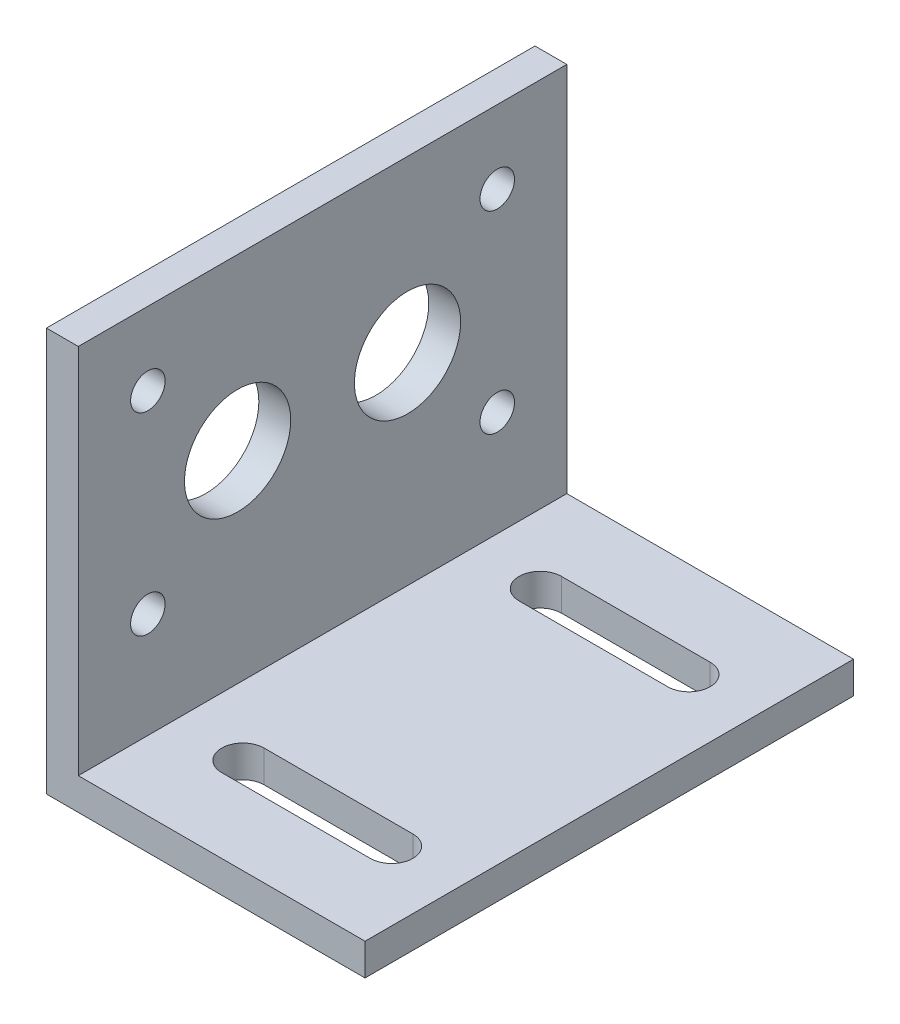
ISO-10303-21;
HEADER;
FILE_DESCRIPTION(('STEP AP214'),'2;1');
FILE_NAME('part.step','',(''),(''),'','','');
FILE_SCHEMA(('AUTOMOTIVE_DESIGN { 1 0 10303 214 1 1 1 1 }'));
ENDSEC;
DATA;
#1=APPLICATION_CONTEXT('core data for automotive mechanical design processes');
#2=APPLICATION_PROTOCOL_DEFINITION('international standard','automotive_design',2000,#1);
#3=PRODUCT_CONTEXT('',#1,'mechanical');
#4=PRODUCT('Part','Part','',(#3));
#5=PRODUCT_RELATED_PRODUCT_CATEGORY('part','',(#4));
#6=PRODUCT_DEFINITION_FORMATION('','',#4);
#7=PRODUCT_DEFINITION_CONTEXT('part definition',#1,'design');
#8=PRODUCT_DEFINITION('design','',#6,#7);
#9=PRODUCT_DEFINITION_SHAPE('','',#8);
#10=(LENGTH_UNIT() NAMED_UNIT(*) SI_UNIT(.MILLI.,.METRE.));
#11=(NAMED_UNIT(*) PLANE_ANGLE_UNIT() SI_UNIT($,.RADIAN.));
#12=(NAMED_UNIT(*) SI_UNIT($,.STERADIAN.) SOLID_ANGLE_UNIT());
#13=UNCERTAINTY_MEASURE_WITH_UNIT(LENGTH_MEASURE(1.E-05),#10,'distance_accuracy_value','');
#14=(GEOMETRIC_REPRESENTATION_CONTEXT(3) GLOBAL_UNCERTAINTY_ASSIGNED_CONTEXT((#13)) GLOBAL_UNIT_ASSIGNED_CONTEXT((#10,
#11,#12)) REPRESENTATION_CONTEXT('',''));
#15=CARTESIAN_POINT('',(0.,0.,0.));
#16=DIRECTION('',(0.,0.,1.));
#17=DIRECTION('',(1.,0.,0.));
#18=AXIS2_PLACEMENT_3D('',#15,#16,#17);
#19=CARTESIAN_POINT('',(-27.,3.,23.));
#20=DIRECTION('',(-1.,0.,0.));
#21=DIRECTION('',(0.,0.,1.));
#22=AXIS2_PLACEMENT_3D('',#19,#20,#21);
#23=PLANE('',#22);
#24=CARTESIAN_POINT('',(-27.,12.91,16.45));
#25=DIRECTION('',(1.,0.,0.));
#26=DIRECTION('',(0.,0.,-1.));
#27=AXIS2_PLACEMENT_3D('',#24,#25,#26);
#28=CIRCLE('',#27,1.625);
#29=CARTESIAN_POINT('',(-27.,12.91,14.825));
#30=VERTEX_POINT('',#29);
#31=EDGE_CURVE('E397',#30,#30,#28,.T.);
#32=ORIENTED_EDGE('',*,*,#31,.F.);
#33=EDGE_LOOP('',(#32));
#34=FACE_BOUND('',#33,.T.);
#35=CARTESIAN_POINT('',(-27.,22.,-8.));
#36=DIRECTION('',(1.,0.,0.));
#37=DIRECTION('',(0.,0.,-1.));
#38=AXIS2_PLACEMENT_3D('',#35,#36,#37);
#39=CIRCLE('',#38,5.);
#40=CARTESIAN_POINT('',(-27.,22.,-13.));
#41=VERTEX_POINT('',#40);
#42=EDGE_CURVE('E403',#41,#41,#39,.T.);
#43=ORIENTED_EDGE('',*,*,#42,.F.);
#44=EDGE_LOOP('',(#43));
#45=FACE_BOUND('',#44,.T.);
#46=CARTESIAN_POINT('',(-27.,31.11,16.45));
#47=DIRECTION('',(1.,0.,0.));
#48=DIRECTION('',(0.,0.,-1.));
#49=AXIS2_PLACEMENT_3D('',#46,#47,#48);
#50=CIRCLE('',#49,1.625);
#51=CARTESIAN_POINT('',(-27.,31.11,14.825));
#52=VERTEX_POINT('',#51);
#53=EDGE_CURVE('E169',#52,#52,#50,.T.);
#54=ORIENTED_EDGE('',*,*,#53,.F.);
#55=EDGE_LOOP('',(#54));
#56=FACE_BOUND('',#55,.T.);
#57=DIRECTION('',(0.,1.,0.));
#58=VECTOR('',#57,1.);
#59=CARTESIAN_POINT('',(-27.,3.,-23.));
#60=LINE('',#59,#58);
#61=CARTESIAN_POINT('',(-27.,3.,-23.));
#62=VERTEX_POINT('',#61);
#63=CARTESIAN_POINT('',(-27.,38.,-23.));
#64=VERTEX_POINT('',#63);
#65=EDGE_CURVE('E235',#62,#64,#60,.T.);
#66=ORIENTED_EDGE('',*,*,#65,.T.);
#67=DIRECTION('',(0.,0.,-1.));
#68=VECTOR('',#67,1.);
#69=CARTESIAN_POINT('',(-27.,38.,23.));
#70=LINE('',#69,#68);
#71=CARTESIAN_POINT('',(-27.,38.,23.));
#72=VERTEX_POINT('',#71);
#73=EDGE_CURVE('E250',#72,#64,#70,.T.);
#74=ORIENTED_EDGE('',*,*,#73,.F.);
#75=DIRECTION('',(0.,1.,0.));
#76=VECTOR('',#75,1.);
#77=CARTESIAN_POINT('',(-27.,3.,23.));
#78=LINE('',#77,#76);
#79=CARTESIAN_POINT('',(-27.,3.,23.));
#80=VERTEX_POINT('',#79);
#81=EDGE_CURVE('E222',#80,#72,#78,.T.);
#82=ORIENTED_EDGE('',*,*,#81,.F.);
#83=DIRECTION('',(0.,0.,-1.));
#84=VECTOR('',#83,1.);
#85=CARTESIAN_POINT('',(-27.,3.,23.));
#86=LINE('',#85,#84);
#87=EDGE_CURVE('E49',#80,#62,#86,.T.);
#88=ORIENTED_EDGE('',*,*,#87,.T.);
#89=EDGE_LOOP('',(#66,#74,#82,#88));
#90=FACE_BOUND('',#89,.T.);
#91=CARTESIAN_POINT('',(-27.,12.91,-16.45));
#92=DIRECTION('',(1.,0.,0.));
#93=DIRECTION('',(0.,0.,-1.));
#94=AXIS2_PLACEMENT_3D('',#91,#92,#93);
#95=CIRCLE('',#94,1.625);
#96=CARTESIAN_POINT('',(-27.,12.91,-18.075));
#97=VERTEX_POINT('',#96);
#98=EDGE_CURVE('E383',#97,#97,#95,.F.);
#99=ORIENTED_EDGE('',*,*,#98,.T.);
#100=EDGE_LOOP('',(#99));
#101=FACE_BOUND('',#100,.T.);
#102=CARTESIAN_POINT('',(-27.,31.11,-16.45));
#103=DIRECTION('',(1.,0.,0.));
#104=DIRECTION('',(0.,0.,-1.));
#105=AXIS2_PLACEMENT_3D('',#102,#103,#104);
#106=CIRCLE('',#105,1.625);
#107=CARTESIAN_POINT('',(-27.,31.11,-18.075));
#108=VERTEX_POINT('',#107);
#109=EDGE_CURVE('E385',#108,#108,#106,.F.);
#110=ORIENTED_EDGE('',*,*,#109,.T.);
#111=EDGE_LOOP('',(#110));
#112=FACE_BOUND('',#111,.T.);
#113=CARTESIAN_POINT('',(-27.,22.,8.));
#114=DIRECTION('',(1.,0.,0.));
#115=DIRECTION('',(0.,0.,-1.));
#116=AXIS2_PLACEMENT_3D('',#113,#114,#115);
#117=CIRCLE('',#116,5.);
#118=CARTESIAN_POINT('',(-27.,22.,3.));
#119=VERTEX_POINT('',#118);
#120=EDGE_CURVE('E391',#119,#119,#117,.F.);
#121=ORIENTED_EDGE('',*,*,#120,.T.);
#122=EDGE_LOOP('',(#121));
#123=FACE_BOUND('',#122,.T.);
#124=ADVANCED_FACE('F41',(#34,#45,#56,#90,#101,#112,#123),#23,.F.);
#125=CARTESIAN_POINT('',(-30.,0.,23.));
#126=DIRECTION('',(1.,0.,0.));
#127=DIRECTION('',(0.,0.,-1.));
#128=AXIS2_PLACEMENT_3D('',#125,#126,#127);
#129=PLANE('',#128);
#130=CARTESIAN_POINT('',(-30.,12.91,16.45));
#131=DIRECTION('',(1.,0.,0.));
#132=DIRECTION('',(0.,0.,-1.));
#133=AXIS2_PLACEMENT_3D('',#130,#131,#132);
#134=CIRCLE('',#133,1.625);
#135=CARTESIAN_POINT('',(-30.,12.91,14.825));
#136=VERTEX_POINT('',#135);
#137=EDGE_CURVE('E394',#136,#136,#134,.T.);
#138=ORIENTED_EDGE('',*,*,#137,.T.);
#139=EDGE_LOOP('',(#138));
#140=FACE_BOUND('',#139,.T.);
#141=CARTESIAN_POINT('',(-30.,22.,-8.));
#142=DIRECTION('',(1.,0.,0.));
#143=DIRECTION('',(0.,0.,-1.));
#144=AXIS2_PLACEMENT_3D('',#141,#142,#143);
#145=CIRCLE('',#144,5.);
#146=CARTESIAN_POINT('',(-30.,22.,-13.));
#147=VERTEX_POINT('',#146);
#148=EDGE_CURVE('E400',#147,#147,#145,.T.);
#149=ORIENTED_EDGE('',*,*,#148,.T.);
#150=EDGE_LOOP('',(#149));
#151=FACE_BOUND('',#150,.T.);
#152=CARTESIAN_POINT('',(-30.,31.11,16.45));
#153=DIRECTION('',(1.,0.,0.));
#154=DIRECTION('',(0.,0.,-1.));
#155=AXIS2_PLACEMENT_3D('',#152,#153,#154);
#156=CIRCLE('',#155,1.625);
#157=CARTESIAN_POINT('',(-30.,31.11,14.825));
#158=VERTEX_POINT('',#157);
#159=EDGE_CURVE('E194',#158,#158,#156,.T.);
#160=ORIENTED_EDGE('',*,*,#159,.T.);
#161=EDGE_LOOP('',(#160));
#162=FACE_BOUND('',#161,.T.);
#163=DIRECTION('',(0.,-1.,0.));
#164=VECTOR('',#163,1.);
#165=CARTESIAN_POINT('',(-30.,0.,-23.));
#166=LINE('',#165,#164);
#167=CARTESIAN_POINT('',(-30.,38.,-23.));
#168=VERTEX_POINT('',#167);
#169=CARTESIAN_POINT('',(-30.,0.,-23.));
#170=VERTEX_POINT('',#169);
#171=EDGE_CURVE('E239',#168,#170,#166,.T.);
#172=ORIENTED_EDGE('',*,*,#171,.T.);
#173=DIRECTION('',(0.,0.,-1.));
#174=VECTOR('',#173,1.);
#175=CARTESIAN_POINT('',(-30.,0.,23.));
#176=LINE('',#175,#174);
#177=CARTESIAN_POINT('',(-30.,0.,23.));
#178=VERTEX_POINT('',#177);
#179=EDGE_CURVE('E244',#178,#170,#176,.T.);
#180=ORIENTED_EDGE('',*,*,#179,.F.);
#181=DIRECTION('',(0.,-1.,0.));
#182=VECTOR('',#181,1.);
#183=CARTESIAN_POINT('',(-30.,0.,23.));
#184=LINE('',#183,#182);
#185=CARTESIAN_POINT('',(-30.,38.,23.));
#186=VERTEX_POINT('',#185);
#187=EDGE_CURVE('E226',#186,#178,#184,.T.);
#188=ORIENTED_EDGE('',*,*,#187,.F.);
#189=DIRECTION('',(0.,0.,-1.));
#190=VECTOR('',#189,1.);
#191=CARTESIAN_POINT('',(-30.,38.,23.));
#192=LINE('',#191,#190);
#193=EDGE_CURVE('E247',#186,#168,#192,.T.);
#194=ORIENTED_EDGE('',*,*,#193,.T.);
#195=EDGE_LOOP('',(#172,#180,#188,#194));
#196=FACE_BOUND('',#195,.T.);
#197=CARTESIAN_POINT('',(-30.,12.91,-16.45));
#198=DIRECTION('',(1.,0.,0.));
#199=DIRECTION('',(0.,0.,-1.));
#200=AXIS2_PLACEMENT_3D('',#197,#198,#199);
#201=CIRCLE('',#200,1.625);
#202=CARTESIAN_POINT('',(-30.,12.91,-18.075));
#203=VERTEX_POINT('',#202);
#204=EDGE_CURVE('E380',#203,#203,#201,.F.);
#205=ORIENTED_EDGE('',*,*,#204,.F.);
#206=EDGE_LOOP('',(#205));
#207=FACE_BOUND('',#206,.T.);
#208=CARTESIAN_POINT('',(-30.,31.11,-16.45));
#209=DIRECTION('',(1.,0.,0.));
#210=DIRECTION('',(0.,0.,-1.));
#211=AXIS2_PLACEMENT_3D('',#208,#209,#210);
#212=CIRCLE('',#211,1.625);
#213=CARTESIAN_POINT('',(-30.,31.11,-18.075));
#214=VERTEX_POINT('',#213);
#215=EDGE_CURVE('E406',#214,#214,#212,.F.);
#216=ORIENTED_EDGE('',*,*,#215,.F.);
#217=EDGE_LOOP('',(#216));
#218=FACE_BOUND('',#217,.T.);
#219=CARTESIAN_POINT('',(-30.,22.,8.));
#220=DIRECTION('',(1.,0.,0.));
#221=DIRECTION('',(0.,0.,-1.));
#222=AXIS2_PLACEMENT_3D('',#219,#220,#221);
#223=CIRCLE('',#222,5.);
#224=CARTESIAN_POINT('',(-30.,22.,3.));
#225=VERTEX_POINT('',#224);
#226=EDGE_CURVE('E388',#225,#225,#223,.F.);
#227=ORIENTED_EDGE('',*,*,#226,.F.);
#228=EDGE_LOOP('',(#227));
#229=FACE_BOUND('',#228,.T.);
#230=ADVANCED_FACE('F272',(#140,#151,#162,#196,#207,#218,#229),#129,.F.);
#231=CARTESIAN_POINT('',(0.,0.,23.));
#232=DIRECTION('',(-1.,0.,0.));
#233=DIRECTION('',(0.,0.,1.));
#234=AXIS2_PLACEMENT_3D('',#231,#232,#233);
#235=PLANE('',#234);
#236=DIRECTION('',(0.,1.,0.));
#237=VECTOR('',#236,1.);
#238=CARTESIAN_POINT('',(0.,0.,-23.));
#239=LINE('',#238,#237);
#240=CARTESIAN_POINT('',(0.,0.,-23.));
#241=VERTEX_POINT('',#240);
#242=CARTESIAN_POINT('',(0.,3.,-23.));
#243=VERTEX_POINT('',#242);
#244=EDGE_CURVE('E181',#241,#243,#239,.T.);
#245=ORIENTED_EDGE('',*,*,#244,.T.);
#246=DIRECTION('',(0.,0.,-1.));
#247=VECTOR('',#246,1.);
#248=CARTESIAN_POINT('',(0.,3.,23.));
#249=LINE('',#248,#247);
#250=CARTESIAN_POINT('',(0.,3.,23.));
#251=VERTEX_POINT('',#250);
#252=EDGE_CURVE('E11',#251,#243,#249,.T.);
#253=ORIENTED_EDGE('',*,*,#252,.F.);
#254=DIRECTION('',(0.,1.,0.));
#255=VECTOR('',#254,1.);
#256=CARTESIAN_POINT('',(0.,0.,23.));
#257=LINE('',#256,#255);
#258=CARTESIAN_POINT('',(0.,0.,23.));
#259=VERTEX_POINT('',#258);
#260=EDGE_CURVE('E216',#259,#251,#257,.T.);
#261=ORIENTED_EDGE('',*,*,#260,.F.);
#262=DIRECTION('',(0.,0.,-1.));
#263=VECTOR('',#262,1.);
#264=CARTESIAN_POINT('',(0.,0.,23.));
#265=LINE('',#264,#263);
#266=EDGE_CURVE('E230',#259,#241,#265,.T.);
#267=ORIENTED_EDGE('',*,*,#266,.T.);
#268=EDGE_LOOP('',(#245,#253,#261,#267));
#269=FACE_BOUND('',#268,.T.);
#270=ADVANCED_FACE('F43',(#269),#235,.F.);
#271=CARTESIAN_POINT('',(0.,3.,23.));
#272=DIRECTION('',(0.,-1.,0.));
#273=DIRECTION('',(0.,0.,-1.));
#274=AXIS2_PLACEMENT_3D('',#271,#272,#273);
#275=PLANE('',#274);
#276=DIRECTION('',(-1.,0.,0.));
#277=VECTOR('',#276,1.);
#278=CARTESIAN_POINT('',(-6.5,3.,12.));
#279=LINE('',#278,#277);
#280=CARTESIAN_POINT('',(-6.5,3.,12.));
#281=VERTEX_POINT('',#280);
#282=CARTESIAN_POINT('',(-20.5,3.,12.));
#283=VERTEX_POINT('',#282);
#284=EDGE_CURVE('E175',#281,#283,#279,.T.);
#285=ORIENTED_EDGE('',*,*,#284,.F.);
#286=CARTESIAN_POINT('',(-6.5,3.,14.));
#287=DIRECTION('',(0.,1.,0.));
#288=DIRECTION('',(0.,0.,1.));
#289=AXIS2_PLACEMENT_3D('',#286,#287,#288);
#290=CIRCLE('',#289,2.);
#291=CARTESIAN_POINT('',(-6.5,3.,16.));
#292=VERTEX_POINT('',#291);
#293=EDGE_CURVE('E56',#292,#281,#290,.T.);
#294=ORIENTED_EDGE('',*,*,#293,.F.);
#295=DIRECTION('',(1.,0.,0.));
#296=VECTOR('',#295,1.);
#297=CARTESIAN_POINT('',(-6.5,3.,16.));
#298=LINE('',#297,#296);
#299=CARTESIAN_POINT('',(-20.5,3.,16.));
#300=VERTEX_POINT('',#299);
#301=EDGE_CURVE('E163',#300,#292,#298,.T.);
#302=ORIENTED_EDGE('',*,*,#301,.F.);
#303=CARTESIAN_POINT('',(-20.5,3.,14.));
#304=DIRECTION('',(0.,1.,0.));
#305=DIRECTION('',(0.,0.,1.));
#306=AXIS2_PLACEMENT_3D('',#303,#304,#305);
#307=CIRCLE('',#306,2.);
#308=EDGE_CURVE('E166',#283,#300,#307,.T.);
#309=ORIENTED_EDGE('',*,*,#308,.F.);
#310=EDGE_LOOP('',(#285,#294,#302,#309));
#311=FACE_BOUND('',#310,.T.);
#312=DIRECTION('',(-1.,0.,0.));
#313=VECTOR('',#312,1.);
#314=CARTESIAN_POINT('',(-6.5,3.,-16.));
#315=LINE('',#314,#313);
#316=CARTESIAN_POINT('',(-6.5,3.,-16.));
#317=VERTEX_POINT('',#316);
#318=CARTESIAN_POINT('',(-20.5,3.,-16.));
#319=VERTEX_POINT('',#318);
#320=EDGE_CURVE('E202',#317,#319,#315,.T.);
#321=ORIENTED_EDGE('',*,*,#320,.F.);
#322=CARTESIAN_POINT('',(-6.5,3.,-14.));
#323=DIRECTION('',(0.,1.,0.));
#324=DIRECTION('',(0.,0.,-1.));
#325=AXIS2_PLACEMENT_3D('',#322,#323,#324);
#326=CIRCLE('',#325,2.);
#327=CARTESIAN_POINT('',(-6.5,3.,-12.));
#328=VERTEX_POINT('',#327);
#329=EDGE_CURVE('E64',#328,#317,#326,.T.);
#330=ORIENTED_EDGE('',*,*,#329,.F.);
#331=DIRECTION('',(1.,0.,0.));
#332=VECTOR('',#331,1.);
#333=CARTESIAN_POINT('',(-6.5,3.,-12.));
#334=LINE('',#333,#332);
#335=CARTESIAN_POINT('',(-20.5,3.,-12.));
#336=VERTEX_POINT('',#335);
#337=EDGE_CURVE('E195',#336,#328,#334,.T.);
#338=ORIENTED_EDGE('',*,*,#337,.F.);
#339=CARTESIAN_POINT('',(-20.5,3.,-14.));
#340=DIRECTION('',(0.,1.,0.));
#341=DIRECTION('',(0.,0.,-1.));
#342=AXIS2_PLACEMENT_3D('',#339,#340,#341);
#343=CIRCLE('',#342,2.);
#344=EDGE_CURVE('E198',#319,#336,#343,.T.);
#345=ORIENTED_EDGE('',*,*,#344,.F.);
#346=EDGE_LOOP('',(#321,#330,#338,#345));
#347=FACE_BOUND('',#346,.T.);
#348=DIRECTION('',(-1.,0.,0.));
#349=VECTOR('',#348,1.);
#350=CARTESIAN_POINT('',(0.,3.,-23.));
#351=LINE('',#350,#349);
#352=EDGE_CURVE('E233',#243,#62,#351,.T.);
#353=ORIENTED_EDGE('',*,*,#352,.T.);
#354=ORIENTED_EDGE('',*,*,#87,.F.);
#355=DIRECTION('',(-1.,0.,0.));
#356=VECTOR('',#355,1.);
#357=CARTESIAN_POINT('',(0.,3.,23.));
#358=LINE('',#357,#356);
#359=EDGE_CURVE('E219',#251,#80,#358,.T.);
#360=ORIENTED_EDGE('',*,*,#359,.F.);
#361=ORIENTED_EDGE('',*,*,#252,.T.);
#362=EDGE_LOOP('',(#353,#354,#360,#361));
#363=FACE_BOUND('',#362,.T.);
#364=ADVANCED_FACE('F281',(#311,#347,#363),#275,.F.);
#365=CARTESIAN_POINT('',(-30.,38.,23.));
#366=DIRECTION('',(0.,-1.,0.));
#367=DIRECTION('',(0.,0.,-1.));
#368=AXIS2_PLACEMENT_3D('',#365,#366,#367);
#369=PLANE('',#368);
#370=DIRECTION('',(-1.,0.,0.));
#371=VECTOR('',#370,1.);
#372=CARTESIAN_POINT('',(-30.,38.,-23.));
#373=LINE('',#372,#371);
#374=EDGE_CURVE('E237',#64,#168,#373,.T.);
#375=ORIENTED_EDGE('',*,*,#374,.T.);
#376=ORIENTED_EDGE('',*,*,#193,.F.);
#377=DIRECTION('',(-1.,0.,0.));
#378=VECTOR('',#377,1.);
#379=CARTESIAN_POINT('',(-30.,38.,23.));
#380=LINE('',#379,#378);
#381=EDGE_CURVE('E224',#72,#186,#380,.T.);
#382=ORIENTED_EDGE('',*,*,#381,.F.);
#383=ORIENTED_EDGE('',*,*,#73,.T.);
#384=EDGE_LOOP('',(#375,#376,#382,#383));
#385=FACE_BOUND('',#384,.T.);
#386=ADVANCED_FACE('F268',(#385),#369,.F.);
#387=CARTESIAN_POINT('',(0.,0.,23.));
#388=DIRECTION('',(0.,1.,0.));
#389=DIRECTION('',(0.,0.,1.));
#390=AXIS2_PLACEMENT_3D('',#387,#388,#389);
#391=PLANE('',#390);
#392=DIRECTION('',(1.,0.,0.));
#393=VECTOR('',#392,1.);
#394=CARTESIAN_POINT('',(-6.5,0.,16.));
#395=LINE('',#394,#393);
#396=CARTESIAN_POINT('',(-20.5,0.,16.));
#397=VERTEX_POINT('',#396);
#398=CARTESIAN_POINT('',(-6.5,0.,16.));
#399=VERTEX_POINT('',#398);
#400=EDGE_CURVE('E150',#397,#399,#395,.T.);
#401=ORIENTED_EDGE('',*,*,#400,.T.);
#402=CARTESIAN_POINT('',(-6.5,0.,14.));
#403=DIRECTION('',(0.,1.,0.));
#404=DIRECTION('',(0.,0.,1.));
#405=AXIS2_PLACEMENT_3D('',#402,#403,#404);
#406=CIRCLE('',#405,2.);
#407=CARTESIAN_POINT('',(-6.5,0.,12.));
#408=VERTEX_POINT('',#407);
#409=EDGE_CURVE('E144',#399,#408,#406,.T.);
#410=ORIENTED_EDGE('',*,*,#409,.T.);
#411=DIRECTION('',(-1.,0.,0.));
#412=VECTOR('',#411,1.);
#413=CARTESIAN_POINT('',(-6.5,0.,12.));
#414=LINE('',#413,#412);
#415=CARTESIAN_POINT('',(-20.5,0.,12.));
#416=VERTEX_POINT('',#415);
#417=EDGE_CURVE('E154',#408,#416,#414,.T.);
#418=ORIENTED_EDGE('',*,*,#417,.T.);
#419=CARTESIAN_POINT('',(-20.5,0.,14.));
#420=DIRECTION('',(0.,1.,0.));
#421=DIRECTION('',(0.,0.,1.));
#422=AXIS2_PLACEMENT_3D('',#419,#420,#421);
#423=CIRCLE('',#422,2.);
#424=EDGE_CURVE('E158',#416,#397,#423,.T.);
#425=ORIENTED_EDGE('',*,*,#424,.T.);
#426=EDGE_LOOP('',(#401,#410,#418,#425));
#427=FACE_BOUND('',#426,.T.);
#428=DIRECTION('',(1.,0.,0.));
#429=VECTOR('',#428,1.);
#430=CARTESIAN_POINT('',(-6.5,0.,-12.));
#431=LINE('',#430,#429);
#432=CARTESIAN_POINT('',(-20.5,0.,-12.));
#433=VERTEX_POINT('',#432);
#434=CARTESIAN_POINT('',(-6.5,0.,-12.));
#435=VERTEX_POINT('',#434);
#436=EDGE_CURVE('E187',#433,#435,#431,.T.);
#437=ORIENTED_EDGE('',*,*,#436,.T.);
#438=CARTESIAN_POINT('',(-6.5,0.,-14.));
#439=DIRECTION('',(0.,1.,0.));
#440=DIRECTION('',(0.,0.,-1.));
#441=AXIS2_PLACEMENT_3D('',#438,#439,#440);
#442=CIRCLE('',#441,2.);
#443=CARTESIAN_POINT('',(-6.5,0.,-16.));
#444=VERTEX_POINT('',#443);
#445=EDGE_CURVE('E199',#435,#444,#442,.T.);
#446=ORIENTED_EDGE('',*,*,#445,.T.);
#447=DIRECTION('',(-1.,0.,0.));
#448=VECTOR('',#447,1.);
#449=CARTESIAN_POINT('',(-6.5,0.,-16.));
#450=LINE('',#449,#448);
#451=CARTESIAN_POINT('',(-20.5,0.,-16.));
#452=VERTEX_POINT('',#451);
#453=EDGE_CURVE('E211',#444,#452,#450,.T.);
#454=ORIENTED_EDGE('',*,*,#453,.T.);
#455=CARTESIAN_POINT('',(-20.5,0.,-14.));
#456=DIRECTION('',(0.,1.,0.));
#457=DIRECTION('',(0.,0.,-1.));
#458=AXIS2_PLACEMENT_3D('',#455,#456,#457);
#459=CIRCLE('',#458,2.);
#460=EDGE_CURVE('E208',#452,#433,#459,.T.);
#461=ORIENTED_EDGE('',*,*,#460,.T.);
#462=EDGE_LOOP('',(#437,#446,#454,#461));
#463=FACE_BOUND('',#462,.T.);
#464=DIRECTION('',(1.,0.,0.));
#465=VECTOR('',#464,1.);
#466=CARTESIAN_POINT('',(0.,0.,-23.));
#467=LINE('',#466,#465);
#468=EDGE_CURVE('E220',#170,#241,#467,.T.);
#469=ORIENTED_EDGE('',*,*,#468,.T.);
#470=ORIENTED_EDGE('',*,*,#266,.F.);
#471=DIRECTION('',(1.,0.,0.));
#472=VECTOR('',#471,1.);
#473=CARTESIAN_POINT('',(0.,0.,23.));
#474=LINE('',#473,#472);
#475=EDGE_CURVE('E228',#178,#259,#474,.T.);
#476=ORIENTED_EDGE('',*,*,#475,.F.);
#477=ORIENTED_EDGE('',*,*,#179,.T.);
#478=EDGE_LOOP('',(#469,#470,#476,#477));
#479=FACE_BOUND('',#478,.T.);
#480=ADVANCED_FACE('F160',(#427,#463,#479),#391,.F.);
#481=CARTESIAN_POINT('',(0.,0.,23.));
#482=DIRECTION('',(0.,0.,1.));
#483=DIRECTION('',(1.,0.,0.));
#484=AXIS2_PLACEMENT_3D('',#481,#482,#483);
#485=PLANE('',#484);
#486=ORIENTED_EDGE('',*,*,#260,.T.);
#487=ORIENTED_EDGE('',*,*,#359,.T.);
#488=ORIENTED_EDGE('',*,*,#81,.T.);
#489=ORIENTED_EDGE('',*,*,#381,.T.);
#490=ORIENTED_EDGE('',*,*,#187,.T.);
#491=ORIENTED_EDGE('',*,*,#475,.T.);
#492=EDGE_LOOP('',(#486,#487,#488,#489,#490,#491));
#493=FACE_BOUND('',#492,.T.);
#494=ADVANCED_FACE('F277',(#493),#485,.T.);
#495=CARTESIAN_POINT('',(0.,0.,-23.));
#496=DIRECTION('',(0.,0.,1.));
#497=DIRECTION('',(1.,0.,0.));
#498=AXIS2_PLACEMENT_3D('',#495,#496,#497);
#499=PLANE('',#498);
#500=ORIENTED_EDGE('',*,*,#244,.F.);
#501=ORIENTED_EDGE('',*,*,#468,.F.);
#502=ORIENTED_EDGE('',*,*,#171,.F.);
#503=ORIENTED_EDGE('',*,*,#374,.F.);
#504=ORIENTED_EDGE('',*,*,#65,.F.);
#505=ORIENTED_EDGE('',*,*,#352,.F.);
#506=EDGE_LOOP('',(#500,#501,#502,#503,#504,#505));
#507=FACE_BOUND('',#506,.T.);
#508=ADVANCED_FACE('F263',(#507),#499,.F.);
#509=CARTESIAN_POINT('',(-6.5,0.,-14.));
#510=DIRECTION('',(0.,1.,0.));
#511=DIRECTION('',(0.,0.,1.));
#512=AXIS2_PLACEMENT_3D('',#509,#510,#511);
#513=CYLINDRICAL_SURFACE('',#512,2.);
#514=ORIENTED_EDGE('',*,*,#329,.T.);
#515=DIRECTION('',(0.,1.,0.));
#516=VECTOR('',#515,1.);
#517=CARTESIAN_POINT('',(-6.5,0.,-16.));
#518=LINE('',#517,#516);
#519=EDGE_CURVE('E185',#444,#317,#518,.T.);
#520=ORIENTED_EDGE('',*,*,#519,.F.);
#521=ORIENTED_EDGE('',*,*,#445,.F.);
#522=DIRECTION('',(0.,1.,0.));
#523=VECTOR('',#522,1.);
#524=CARTESIAN_POINT('',(-6.5,0.,-12.));
#525=LINE('',#524,#523);
#526=EDGE_CURVE('E192',#435,#328,#525,.T.);
#527=ORIENTED_EDGE('',*,*,#526,.T.);
#528=EDGE_LOOP('',(#514,#520,#521,#527));
#529=FACE_BOUND('',#528,.T.);
#530=ADVANCED_FACE('F318',(#529),#513,.F.);
#531=CARTESIAN_POINT('',(-6.5,0.,-12.));
#532=DIRECTION('',(0.,0.,1.));
#533=DIRECTION('',(1.,0.,0.));
#534=AXIS2_PLACEMENT_3D('',#531,#532,#533);
#535=PLANE('',#534);
#536=ORIENTED_EDGE('',*,*,#337,.T.);
#537=ORIENTED_EDGE('',*,*,#526,.F.);
#538=ORIENTED_EDGE('',*,*,#436,.F.);
#539=DIRECTION('',(0.,1.,0.));
#540=VECTOR('',#539,1.);
#541=CARTESIAN_POINT('',(-20.5,0.,-12.));
#542=LINE('',#541,#540);
#543=EDGE_CURVE('E190',#433,#336,#542,.T.);
#544=ORIENTED_EDGE('',*,*,#543,.T.);
#545=EDGE_LOOP('',(#536,#537,#538,#544));
#546=FACE_BOUND('',#545,.T.);
#547=ADVANCED_FACE('F321',(#546),#535,.F.);
#548=CARTESIAN_POINT('',(-20.5,0.,-14.));
#549=DIRECTION('',(0.,1.,0.));
#550=DIRECTION('',(0.,0.,1.));
#551=AXIS2_PLACEMENT_3D('',#548,#549,#550);
#552=CYLINDRICAL_SURFACE('',#551,2.);
#553=ORIENTED_EDGE('',*,*,#344,.T.);
#554=ORIENTED_EDGE('',*,*,#543,.F.);
#555=ORIENTED_EDGE('',*,*,#460,.F.);
#556=DIRECTION('',(0.,1.,0.));
#557=VECTOR('',#556,1.);
#558=CARTESIAN_POINT('',(-20.5,0.,-16.));
#559=LINE('',#558,#557);
#560=EDGE_CURVE('E188',#452,#319,#559,.T.);
#561=ORIENTED_EDGE('',*,*,#560,.T.);
#562=EDGE_LOOP('',(#553,#554,#555,#561));
#563=FACE_BOUND('',#562,.T.);
#564=ADVANCED_FACE('F323',(#563),#552,.F.);
#565=CARTESIAN_POINT('',(-6.5,0.,-16.));
#566=DIRECTION('',(0.,0.,-1.));
#567=DIRECTION('',(-1.,0.,0.));
#568=AXIS2_PLACEMENT_3D('',#565,#566,#567);
#569=PLANE('',#568);
#570=ORIENTED_EDGE('',*,*,#320,.T.);
#571=ORIENTED_EDGE('',*,*,#560,.F.);
#572=ORIENTED_EDGE('',*,*,#453,.F.);
#573=ORIENTED_EDGE('',*,*,#519,.T.);
#574=EDGE_LOOP('',(#570,#571,#572,#573));
#575=FACE_BOUND('',#574,.T.);
#576=ADVANCED_FACE('F315',(#575),#569,.F.);
#577=CARTESIAN_POINT('',(-6.5,0.,14.));
#578=DIRECTION('',(0.,1.,0.));
#579=DIRECTION('',(0.,0.,1.));
#580=AXIS2_PLACEMENT_3D('',#577,#578,#579);
#581=CYLINDRICAL_SURFACE('',#580,2.);
#582=ORIENTED_EDGE('',*,*,#293,.T.);
#583=DIRECTION('',(0.,1.,0.));
#584=VECTOR('',#583,1.);
#585=CARTESIAN_POINT('',(-6.5,0.,12.));
#586=LINE('',#585,#584);
#587=EDGE_CURVE('E140',#408,#281,#586,.T.);
#588=ORIENTED_EDGE('',*,*,#587,.F.);
#589=ORIENTED_EDGE('',*,*,#409,.F.);
#590=DIRECTION('',(0.,1.,0.));
#591=VECTOR('',#590,1.);
#592=CARTESIAN_POINT('',(-6.5,0.,16.));
#593=LINE('',#592,#591);
#594=EDGE_CURVE('E179',#399,#292,#593,.T.);
#595=ORIENTED_EDGE('',*,*,#594,.T.);
#596=EDGE_LOOP('',(#582,#588,#589,#595));
#597=FACE_BOUND('',#596,.T.);
#598=ADVANCED_FACE('F142',(#597),#581,.F.);
#599=CARTESIAN_POINT('',(-6.5,0.,16.));
#600=DIRECTION('',(0.,0.,1.));
#601=DIRECTION('',(1.,0.,0.));
#602=AXIS2_PLACEMENT_3D('',#599,#600,#601);
#603=PLANE('',#602);
#604=ORIENTED_EDGE('',*,*,#301,.T.);
#605=ORIENTED_EDGE('',*,*,#594,.F.);
#606=ORIENTED_EDGE('',*,*,#400,.F.);
#607=DIRECTION('',(0.,1.,0.));
#608=VECTOR('',#607,1.);
#609=CARTESIAN_POINT('',(-20.5,0.,16.));
#610=LINE('',#609,#608);
#611=EDGE_CURVE('E182',#397,#300,#610,.T.);
#612=ORIENTED_EDGE('',*,*,#611,.T.);
#613=EDGE_LOOP('',(#604,#605,#606,#612));
#614=FACE_BOUND('',#613,.T.);
#615=ADVANCED_FACE('F342',(#614),#603,.F.);
#616=CARTESIAN_POINT('',(-20.5,0.,14.));
#617=DIRECTION('',(0.,1.,0.));
#618=DIRECTION('',(0.,0.,1.));
#619=AXIS2_PLACEMENT_3D('',#616,#617,#618);
#620=CYLINDRICAL_SURFACE('',#619,2.);
#621=ORIENTED_EDGE('',*,*,#308,.T.);
#622=ORIENTED_EDGE('',*,*,#611,.F.);
#623=ORIENTED_EDGE('',*,*,#424,.F.);
#624=DIRECTION('',(0.,1.,0.));
#625=VECTOR('',#624,1.);
#626=CARTESIAN_POINT('',(-20.5,0.,12.));
#627=LINE('',#626,#625);
#628=EDGE_CURVE('E149',#416,#283,#627,.T.);
#629=ORIENTED_EDGE('',*,*,#628,.T.);
#630=EDGE_LOOP('',(#621,#622,#623,#629));
#631=FACE_BOUND('',#630,.T.);
#632=ADVANCED_FACE('F346',(#631),#620,.F.);
#633=CARTESIAN_POINT('',(-6.5,0.,12.));
#634=DIRECTION('',(0.,0.,-1.));
#635=DIRECTION('',(-1.,0.,0.));
#636=AXIS2_PLACEMENT_3D('',#633,#634,#635);
#637=PLANE('',#636);
#638=ORIENTED_EDGE('',*,*,#284,.T.);
#639=ORIENTED_EDGE('',*,*,#628,.F.);
#640=ORIENTED_EDGE('',*,*,#417,.F.);
#641=ORIENTED_EDGE('',*,*,#587,.T.);
#642=EDGE_LOOP('',(#638,#639,#640,#641));
#643=FACE_BOUND('',#642,.T.);
#644=ADVANCED_FACE('F155',(#643),#637,.F.);
#645=CARTESIAN_POINT('',(-30.,31.11,16.45));
#646=DIRECTION('',(1.,0.,0.));
#647=DIRECTION('',(0.,0.,-1.));
#648=AXIS2_PLACEMENT_3D('',#645,#646,#647);
#649=CYLINDRICAL_SURFACE('',#648,1.625);
#650=ORIENTED_EDGE('',*,*,#159,.F.);
#651=EDGE_LOOP('',(#650));
#652=FACE_BOUND('',#651,.T.);
#653=ORIENTED_EDGE('',*,*,#53,.T.);
#654=EDGE_LOOP('',(#653));
#655=FACE_BOUND('',#654,.T.);
#656=ADVANCED_FACE('F345',(#652,#655),#649,.F.);
#657=CARTESIAN_POINT('',(-30.,12.91,-16.45));
#658=DIRECTION('',(1.,0.,0.));
#659=DIRECTION('',(0.,0.,-1.));
#660=AXIS2_PLACEMENT_3D('',#657,#658,#659);
#661=CYLINDRICAL_SURFACE('',#660,1.625);
#662=ORIENTED_EDGE('',*,*,#204,.T.);
#663=EDGE_LOOP('',(#662));
#664=FACE_BOUND('',#663,.T.);
#665=ORIENTED_EDGE('',*,*,#98,.F.);
#666=EDGE_LOOP('',(#665));
#667=FACE_BOUND('',#666,.T.);
#668=ADVANCED_FACE('F355',(#664,#667),#661,.F.);
#669=CARTESIAN_POINT('',(-30.,31.11,-16.45));
#670=DIRECTION('',(1.,0.,0.));
#671=DIRECTION('',(0.,0.,-1.));
#672=AXIS2_PLACEMENT_3D('',#669,#670,#671);
#673=CYLINDRICAL_SURFACE('',#672,1.625);
#674=ORIENTED_EDGE('',*,*,#215,.T.);
#675=EDGE_LOOP('',(#674));
#676=FACE_BOUND('',#675,.T.);
#677=ORIENTED_EDGE('',*,*,#109,.F.);
#678=EDGE_LOOP('',(#677));
#679=FACE_BOUND('',#678,.T.);
#680=ADVANCED_FACE('F357',(#676,#679),#673,.F.);
#681=CARTESIAN_POINT('',(-30.,22.,-8.));
#682=DIRECTION('',(1.,0.,0.));
#683=DIRECTION('',(0.,0.,-1.));
#684=AXIS2_PLACEMENT_3D('',#681,#682,#683);
#685=CYLINDRICAL_SURFACE('',#684,5.);
#686=ORIENTED_EDGE('',*,*,#148,.F.);
#687=EDGE_LOOP('',(#686));
#688=FACE_BOUND('',#687,.T.);
#689=ORIENTED_EDGE('',*,*,#42,.T.);
#690=EDGE_LOOP('',(#689));
#691=FACE_BOUND('',#690,.T.);
#692=ADVANCED_FACE('F360',(#688,#691),#685,.F.);
#693=CARTESIAN_POINT('',(-30.,12.91,16.45));
#694=DIRECTION('',(1.,0.,0.));
#695=DIRECTION('',(0.,0.,-1.));
#696=AXIS2_PLACEMENT_3D('',#693,#694,#695);
#697=CYLINDRICAL_SURFACE('',#696,1.625);
#698=ORIENTED_EDGE('',*,*,#137,.F.);
#699=EDGE_LOOP('',(#698));
#700=FACE_BOUND('',#699,.T.);
#701=ORIENTED_EDGE('',*,*,#31,.T.);
#702=EDGE_LOOP('',(#701));
#703=FACE_BOUND('',#702,.T.);
#704=ADVANCED_FACE('F364',(#700,#703),#697,.F.);
#705=CARTESIAN_POINT('',(-30.,22.,8.));
#706=DIRECTION('',(1.,0.,0.));
#707=DIRECTION('',(0.,0.,-1.));
#708=AXIS2_PLACEMENT_3D('',#705,#706,#707);
#709=CYLINDRICAL_SURFACE('',#708,5.);
#710=ORIENTED_EDGE('',*,*,#226,.T.);
#711=EDGE_LOOP('',(#710));
#712=FACE_BOUND('',#711,.T.);
#713=ORIENTED_EDGE('',*,*,#120,.F.);
#714=EDGE_LOOP('',(#713));
#715=FACE_BOUND('',#714,.T.);
#716=ADVANCED_FACE('F368',(#712,#715),#709,.F.);
#717=CLOSED_SHELL('',(#124,#230,#270,#364,#386,#480,#494,#508,#530,#547,#564,#576,#598,#615,
#632,#644,#656,#668,#680,#692,#704,#716));
#718=MANIFOLD_SOLID_BREP('B2',#717);
#719=ADVANCED_BREP_SHAPE_REPRESENTATION('',(#18,#718),#14);
#720=SHAPE_DEFINITION_REPRESENTATION(#9,#719);
ENDSEC;
END-ISO-10303-21;
